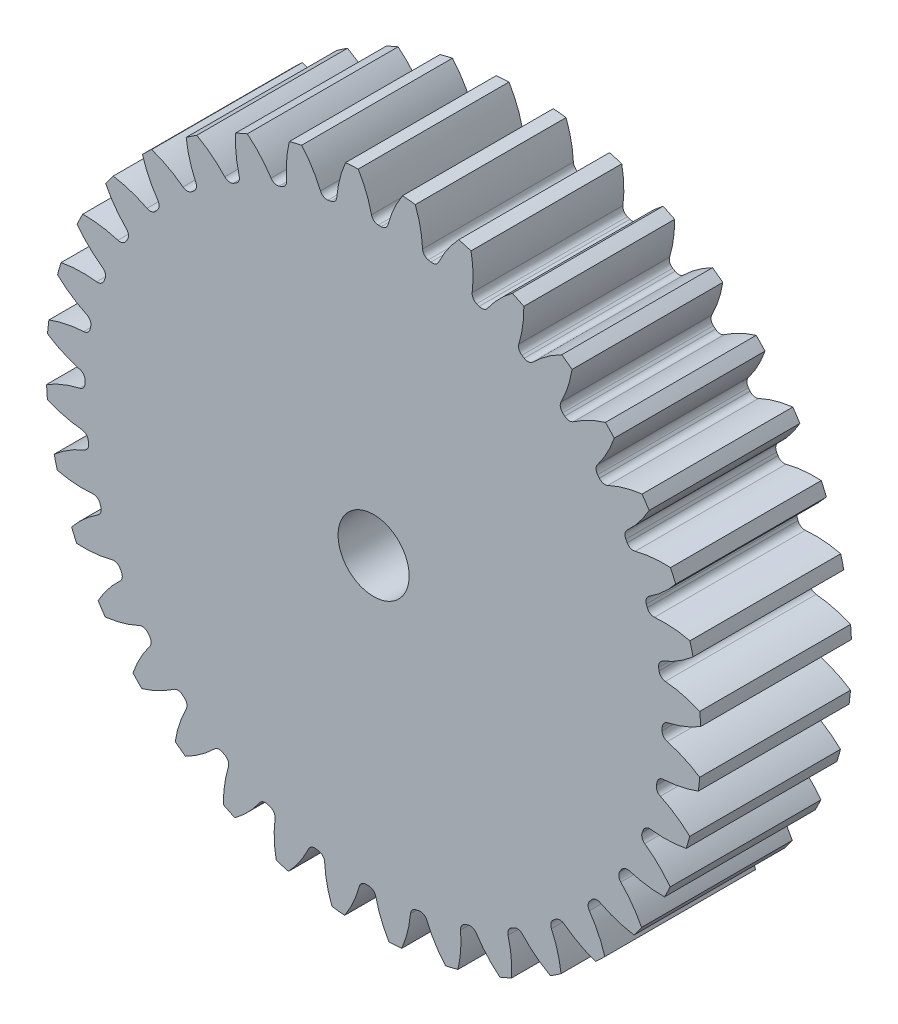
from build123d import *

# Parameters (mm, degrees)
SKETCH3_R         = 193.04
GEARBODY_DEPTH    = 88.9
TOOTHCUT_DEPTH    = 288.109897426
CIRPATTERN1_COUNT = 36
BOREDIA_R         = 20.955
BORE_DEPTH        = 12700


with BuildPart() as part:
    # Sketch3 → gearBody (new body)
    with BuildSketch(Plane.XY):
        Circle(SKETCH3_R)
    extrude(amount=GEARBODY_DEPTH)

    # Sketch2 → toothCut (cut, through all)
    with BuildSketch(Plane.XY):
        with BuildLine():
            ThreePointArc((170.124122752, -4.360648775), (170.143181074, -3.539821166), (170.158279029, -2.718911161))
            ThreePointArc((170.158279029, -2.718911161), (171.082820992, -0.178293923), (173.379584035, 1.248027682))
            ThreePointArc((173.379584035, 1.248027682), (183.529797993, 4.423161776), (193.04, 9.183873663))
            ThreePointArc((193.04, 9.183873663), (193.216525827, -4.019861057), (192.490984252, -17.204828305))
            ThreePointArc((192.490984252, -17.204828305), (183.187018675, -12.052688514), (173.177647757, -8.458135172))
            ThreePointArc((173.177647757, -8.458135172), (170.942195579, -6.937521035), (170.124122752, -4.360648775))
        make_face()
    toothcut = extrude(amount=TOOTHCUT_DEPTH, mode=Mode.SUBTRACT)

    # CirPattern1: toothCut ×36 about axis
    cirpattern1_axis = Axis((0, 0, 0), (0, 0, 1))
    for i in range(1, CIRPATTERN1_COUNT):
        add(toothcut.rotate(cirpattern1_axis, i * 360 / CIRPATTERN1_COUNT), mode=Mode.SUBTRACT)

    # boreDia → bore (cut, symmetric)
    with BuildSketch(Plane.XY):
        Circle(BOREDIA_R)
    extrude(amount=BORE_DEPTH, both=True, mode=Mode.SUBTRACT)


solid = part.part
